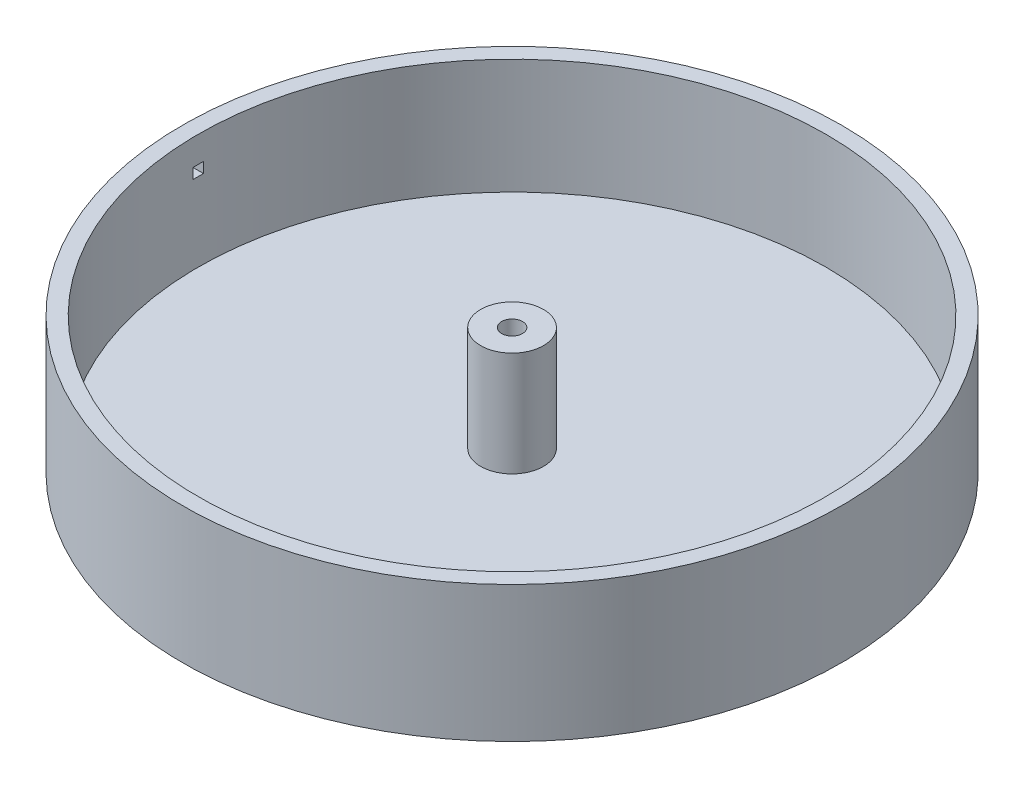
from build123d import *

# Parameters (mm, degrees)
CUT_EXTRUDE1_START = -50.8
SKETCH5_W          = 6.35
SKETCH5_H          = 6.35
CUT_EXTRUDE1_DEPTH = 244.876948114


with BuildPart() as part:
    # Sketch6 → Revolve1 (revolve)
    with BuildSketch(Plane.XY, mode=Mode.PRIVATE) as revolve1_sk:
        Polygon((-6.35, 76.2), (-6.35, 0), (-200.025, 0), (-200.025, 82.55), (-190.5, 82.55), (-190.5, 12.7), (-19.05, 12.7), (-19.05, 76.2), align=None)
    revolve(revolve1_sk.sketch.rotate(Axis((0, 0, 0), (0, 1, 0)), 270), axis=Axis((0, 0, 0), (0, 1, 0)))

    # Sketch5 → Cut-Extrude1 (cut, through all)
    with BuildSketch(Plane(origin=(0, 0, 0), x_dir=(0, 0, -1), z_dir=(1, 0, 0)).offset(CUT_EXTRUDE1_START)):
        with Locations((0, 63.5)):
            Rectangle(SKETCH5_W, SKETCH5_H)
    extrude(amount=-CUT_EXTRUDE1_DEPTH, mode=Mode.SUBTRACT)


solid = part.part
